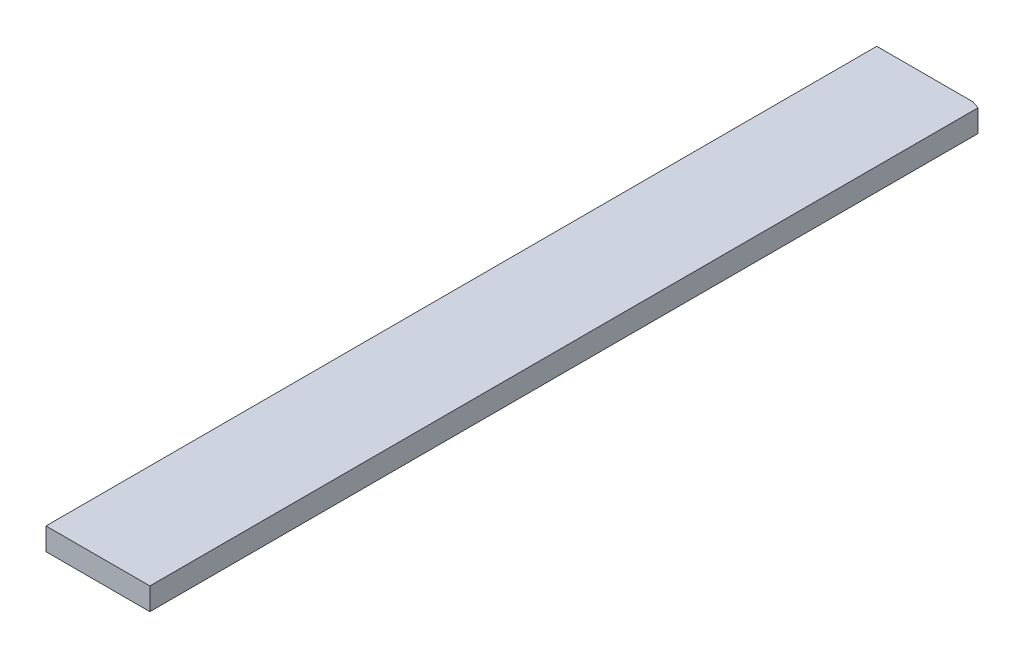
ISO-10303-21;
HEADER;
FILE_DESCRIPTION(('STEP AP214'),'2;1');
FILE_NAME('part.step','',(''),(''),'','','');
FILE_SCHEMA(('AUTOMOTIVE_DESIGN { 1 0 10303 214 1 1 1 1 }'));
ENDSEC;
DATA;
#1=APPLICATION_CONTEXT('core data for automotive mechanical design processes');
#2=APPLICATION_PROTOCOL_DEFINITION('international standard','automotive_design',2000,#1);
#3=PRODUCT_CONTEXT('',#1,'mechanical');
#4=PRODUCT('Part','Part','',(#3));
#5=PRODUCT_RELATED_PRODUCT_CATEGORY('part','',(#4));
#6=PRODUCT_DEFINITION_FORMATION('','',#4);
#7=PRODUCT_DEFINITION_CONTEXT('part definition',#1,'design');
#8=PRODUCT_DEFINITION('design','',#6,#7);
#9=PRODUCT_DEFINITION_SHAPE('','',#8);
#10=(LENGTH_UNIT() NAMED_UNIT(*) SI_UNIT(.MILLI.,.METRE.));
#11=(NAMED_UNIT(*) PLANE_ANGLE_UNIT() SI_UNIT($,.RADIAN.));
#12=(NAMED_UNIT(*) SI_UNIT($,.STERADIAN.) SOLID_ANGLE_UNIT());
#13=UNCERTAINTY_MEASURE_WITH_UNIT(LENGTH_MEASURE(1.E-05),#10,'distance_accuracy_value','');
#14=(GEOMETRIC_REPRESENTATION_CONTEXT(3) GLOBAL_UNCERTAINTY_ASSIGNED_CONTEXT((#13)) GLOBAL_UNIT_ASSIGNED_CONTEXT((#10,
#11,#12)) REPRESENTATION_CONTEXT('',''));
#15=CARTESIAN_POINT('',(0.,0.,0.));
#16=DIRECTION('',(0.,0.,1.));
#17=DIRECTION('',(1.,0.,0.));
#18=AXIS2_PLACEMENT_3D('',#15,#16,#17);
#19=CARTESIAN_POINT('',(295.275,127.,-2587.67072));
#20=DIRECTION('',(-1.,0.,0.));
#21=DIRECTION('',(0.,0.,1.));
#22=AXIS2_PLACEMENT_3D('',#19,#20,#21);
#23=PLANE('',#22);
#24=DIRECTION('',(0.,0.,-1.));
#25=VECTOR('',#24,1.);
#26=CARTESIAN_POINT('',(295.275,0.,-2587.67072));
#27=LINE('',#26,#25);
#28=CARTESIAN_POINT('',(295.275,0.,2134.93246755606));
#29=VERTEX_POINT('',#28);
#30=CARTESIAN_POINT('',(295.275,0.,-2572.60177836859));
#31=VERTEX_POINT('',#30);
#32=EDGE_CURVE('E91',#29,#31,#27,.T.);
#33=ORIENTED_EDGE('',*,*,#32,.T.);
#34=DIRECTION('',(0.,-1.,0.));
#35=VECTOR('',#34,1.);
#36=CARTESIAN_POINT('',(295.275,127.,-2572.60177836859));
#37=LINE('',#36,#35);
#38=CARTESIAN_POINT('',(295.275,127.,-2572.60177836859));
#39=VERTEX_POINT('',#38);
#40=EDGE_CURVE('E46',#39,#31,#37,.T.);
#41=ORIENTED_EDGE('',*,*,#40,.F.);
#42=DIRECTION('',(0.,0.,-1.));
#43=VECTOR('',#42,1.);
#44=CARTESIAN_POINT('',(295.275,127.,-2587.67072));
#45=LINE('',#44,#43);
#46=CARTESIAN_POINT('',(295.275,127.,2134.93246755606));
#47=VERTEX_POINT('',#46);
#48=EDGE_CURVE('E89',#47,#39,#45,.T.);
#49=ORIENTED_EDGE('',*,*,#48,.F.);
#50=DIRECTION('',(0.,-1.,0.));
#51=VECTOR('',#50,1.);
#52=CARTESIAN_POINT('',(295.275,127.,2134.93246755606));
#53=LINE('',#52,#51);
#54=EDGE_CURVE('E108',#47,#29,#53,.T.);
#55=ORIENTED_EDGE('',*,*,#54,.T.);
#56=EDGE_LOOP('',(#33,#41,#49,#55));
#57=FACE_BOUND('',#56,.T.);
#58=ADVANCED_FACE('F32',(#57),#23,.F.);
#59=CARTESIAN_POINT('',(-295.275,127.,-2587.67072));
#60=DIRECTION('',(0.,0.,1.));
#61=DIRECTION('',(1.,0.,0.));
#62=AXIS2_PLACEMENT_3D('',#59,#60,#61);
#63=PLANE('',#62);
#64=DIRECTION('',(-1.,0.,0.));
#65=VECTOR('',#64,1.);
#66=CARTESIAN_POINT('',(-295.275,127.,-2587.67072));
#67=LINE('',#66,#65);
#68=CARTESIAN_POINT('',(251.51161579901,127.,-2587.67072));
#69=VERTEX_POINT('',#68);
#70=CARTESIAN_POINT('',(-295.275,127.,-2587.67072));
#71=VERTEX_POINT('',#70);
#72=EDGE_CURVE('E97',#69,#71,#67,.T.);
#73=ORIENTED_EDGE('',*,*,#72,.F.);
#74=DIRECTION('',(0.,-1.,0.));
#75=VECTOR('',#74,1.);
#76=CARTESIAN_POINT('',(251.51161579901,127.,-2587.67072));
#77=LINE('',#76,#75);
#78=CARTESIAN_POINT('',(251.51161579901,0.,-2587.67072));
#79=VERTEX_POINT('',#78);
#80=EDGE_CURVE('E79',#69,#79,#77,.T.);
#81=ORIENTED_EDGE('',*,*,#80,.T.);
#82=DIRECTION('',(-1.,0.,0.));
#83=VECTOR('',#82,1.);
#84=CARTESIAN_POINT('',(-295.275,0.,-2587.67072));
#85=LINE('',#84,#83);
#86=CARTESIAN_POINT('',(-295.275,0.,-2587.67072));
#87=VERTEX_POINT('',#86);
#88=EDGE_CURVE('E102',#79,#87,#85,.T.);
#89=ORIENTED_EDGE('',*,*,#88,.T.);
#90=DIRECTION('',(0.,-1.,0.));
#91=VECTOR('',#90,1.);
#92=CARTESIAN_POINT('',(-295.275,127.,-2587.67072));
#93=LINE('',#92,#91);
#94=EDGE_CURVE('E11',#71,#87,#93,.T.);
#95=ORIENTED_EDGE('',*,*,#94,.F.);
#96=EDGE_LOOP('',(#73,#81,#89,#95));
#97=FACE_BOUND('',#96,.T.);
#98=ADVANCED_FACE('F112',(#97),#63,.F.);
#99=CARTESIAN_POINT('',(-295.275,127.,-2587.67072));
#100=DIRECTION('',(1.,0.,0.));
#101=DIRECTION('',(0.,0.,-1.));
#102=AXIS2_PLACEMENT_3D('',#99,#100,#101);
#103=PLANE('',#102);
#104=DIRECTION('',(0.,0.,1.));
#105=VECTOR('',#104,1.);
#106=CARTESIAN_POINT('',(-295.275,0.,-2587.67072));
#107=LINE('',#106,#105);
#108=CARTESIAN_POINT('',(-295.275,0.,2134.93246755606));
#109=VERTEX_POINT('',#108);
#110=EDGE_CURVE('E98',#87,#109,#107,.T.);
#111=ORIENTED_EDGE('',*,*,#110,.T.);
#112=DIRECTION('',(0.,-1.,0.));
#113=VECTOR('',#112,1.);
#114=CARTESIAN_POINT('',(-295.275,127.,2134.93246755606));
#115=LINE('',#114,#113);
#116=CARTESIAN_POINT('',(-295.275,127.,2134.93246755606));
#117=VERTEX_POINT('',#116);
#118=EDGE_CURVE('E54',#117,#109,#115,.T.);
#119=ORIENTED_EDGE('',*,*,#118,.F.);
#120=DIRECTION('',(0.,0.,1.));
#121=VECTOR('',#120,1.);
#122=CARTESIAN_POINT('',(-295.275,127.,-2587.67072));
#123=LINE('',#122,#121);
#124=EDGE_CURVE('E39',#71,#117,#123,.T.);
#125=ORIENTED_EDGE('',*,*,#124,.F.);
#126=ORIENTED_EDGE('',*,*,#94,.T.);
#127=EDGE_LOOP('',(#111,#119,#125,#126));
#128=FACE_BOUND('',#127,.T.);
#129=ADVANCED_FACE('F117',(#128),#103,.F.);
#130=CARTESIAN_POINT('',(295.275,127.,2587.67072));
#131=DIRECTION('',(0.,1.,0.));
#132=DIRECTION('',(0.,0.,1.));
#133=AXIS2_PLACEMENT_3D('',#130,#131,#132);
#134=PLANE('',#133);
#135=DIRECTION('',(-0.945518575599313,0.,-0.325568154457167));
#136=VECTOR('',#135,1.);
#137=CARTESIAN_POINT('',(295.275,127.,-2572.60177836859));
#138=LINE('',#137,#136);
#139=EDGE_CURVE('E76',#39,#69,#138,.T.);
#140=ORIENTED_EDGE('',*,*,#139,.T.);
#141=ORIENTED_EDGE('',*,*,#72,.T.);
#142=ORIENTED_EDGE('',*,*,#124,.T.);
#143=DIRECTION('',(1.,0.,0.));
#144=VECTOR('',#143,1.);
#145=CARTESIAN_POINT('',(-295.275,127.,2134.93246755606));
#146=LINE('',#145,#144);
#147=EDGE_CURVE('E96',#117,#47,#146,.T.);
#148=ORIENTED_EDGE('',*,*,#147,.T.);
#149=ORIENTED_EDGE('',*,*,#48,.T.);
#150=EDGE_LOOP('',(#140,#141,#142,#148,#149));
#151=FACE_BOUND('',#150,.T.);
#152=ADVANCED_FACE('F94',(#151),#134,.T.);
#153=CARTESIAN_POINT('',(295.275,0.,2587.67072));
#154=DIRECTION('',(0.,1.,0.));
#155=DIRECTION('',(0.,0.,1.));
#156=AXIS2_PLACEMENT_3D('',#153,#154,#155);
#157=PLANE('',#156);
#158=ORIENTED_EDGE('',*,*,#88,.F.);
#159=DIRECTION('',(-0.945518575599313,0.,-0.325568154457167));
#160=VECTOR('',#159,1.);
#161=CARTESIAN_POINT('',(295.275,0.,-2572.60177836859));
#162=LINE('',#161,#160);
#163=EDGE_CURVE('E83',#31,#79,#162,.T.);
#164=ORIENTED_EDGE('',*,*,#163,.F.);
#165=ORIENTED_EDGE('',*,*,#32,.F.);
#166=DIRECTION('',(1.,0.,0.));
#167=VECTOR('',#166,1.);
#168=CARTESIAN_POINT('',(-295.275,0.,2134.93246755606));
#169=LINE('',#168,#167);
#170=EDGE_CURVE('E119',#109,#29,#169,.T.);
#171=ORIENTED_EDGE('',*,*,#170,.F.);
#172=ORIENTED_EDGE('',*,*,#110,.F.);
#173=EDGE_LOOP('',(#158,#164,#165,#171,#172));
#174=FACE_BOUND('',#173,.T.);
#175=ADVANCED_FACE('F118',(#174),#157,.F.);
#176=CARTESIAN_POINT('',(-295.275,127.,2134.93246755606));
#177=DIRECTION('',(0.,0.,-1.));
#178=DIRECTION('',(-1.,0.,0.));
#179=AXIS2_PLACEMENT_3D('',#176,#177,#178);
#180=PLANE('',#179);
#181=ORIENTED_EDGE('',*,*,#170,.T.);
#182=ORIENTED_EDGE('',*,*,#54,.F.);
#183=ORIENTED_EDGE('',*,*,#147,.F.);
#184=ORIENTED_EDGE('',*,*,#118,.T.);
#185=EDGE_LOOP('',(#181,#182,#183,#184));
#186=FACE_BOUND('',#185,.T.);
#187=ADVANCED_FACE('F123',(#186),#180,.F.);
#188=CARTESIAN_POINT('',(295.275,127.,-2572.60177836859));
#189=DIRECTION('',(-0.325568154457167,0.,0.945518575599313));
#190=DIRECTION('',(0.945518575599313,0.,0.325568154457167));
#191=AXIS2_PLACEMENT_3D('',#188,#189,#190);
#192=PLANE('',#191);
#193=ORIENTED_EDGE('',*,*,#163,.T.);
#194=ORIENTED_EDGE('',*,*,#80,.F.);
#195=ORIENTED_EDGE('',*,*,#139,.F.);
#196=ORIENTED_EDGE('',*,*,#40,.T.);
#197=EDGE_LOOP('',(#193,#194,#195,#196));
#198=FACE_BOUND('',#197,.T.);
#199=ADVANCED_FACE('F77',(#198),#192,.F.);
#200=CLOSED_SHELL('',(#58,#98,#129,#152,#175,#187,#199));
#201=MANIFOLD_SOLID_BREP('B2',#200);
#202=ADVANCED_BREP_SHAPE_REPRESENTATION('',(#18,#201),#14);
#203=SHAPE_DEFINITION_REPRESENTATION(#9,#202);
ENDSEC;
END-ISO-10303-21;
